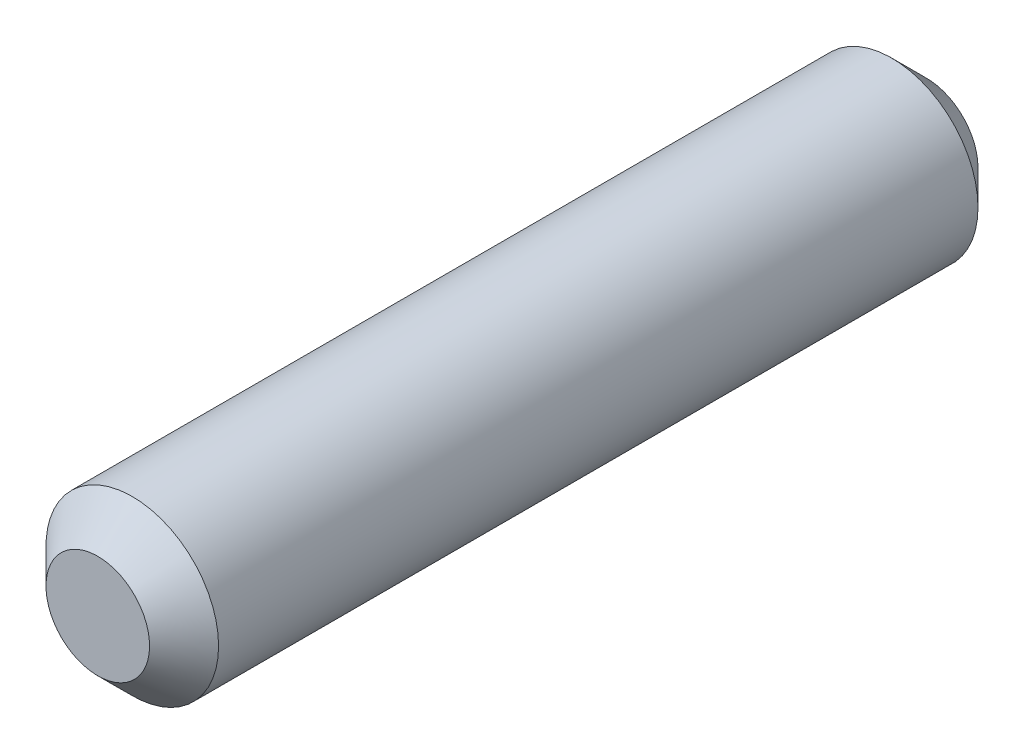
from build123d import *

# Parameters (mm, degrees)
ESQUISSE1_R          = 2.5
BASE_EXTRUSION_DEPTH = 24
CHANFREIN1_SIZE      = 1


with BuildPart() as part:
    # Esquisse1 → Base-Extrusion (new body)
    with BuildSketch(Plane.XY):
        Circle(ESQUISSE1_R)
    extrude(amount=BASE_EXTRUSION_DEPTH)

    # Chanfrein1
    chanfrein1_edges = [part.edges().sort_by_distance(p)[0] for p in [
        (-2.5, 0, 0),
        (-2.5, 0, 24),
    ]]
    chamfer(chanfrein1_edges, length=CHANFREIN1_SIZE)


solid = part.part
